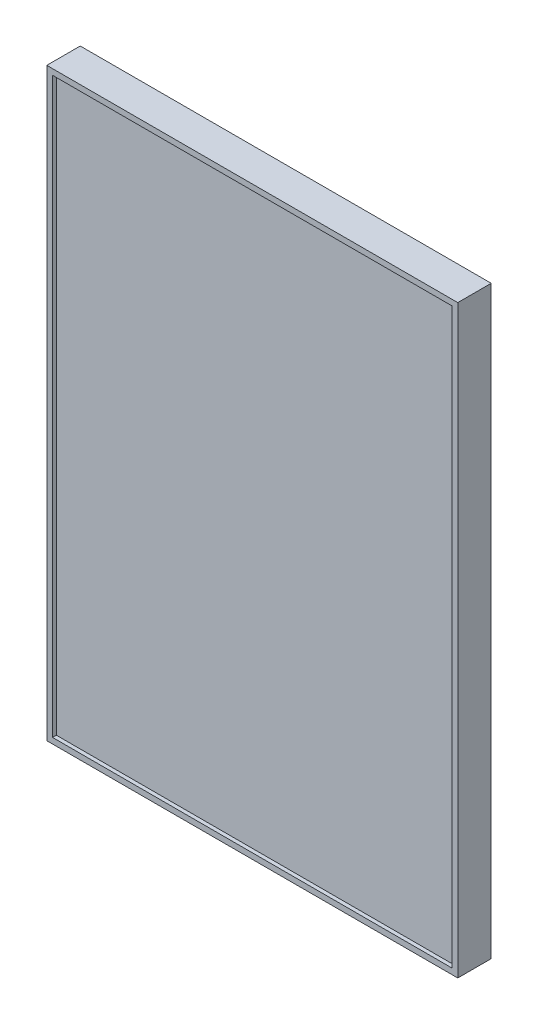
ISO-10303-21;
HEADER;
FILE_DESCRIPTION(('STEP AP214'),'2;1');
FILE_NAME('part.step','',(''),(''),'','','');
FILE_SCHEMA(('AUTOMOTIVE_DESIGN { 1 0 10303 214 1 1 1 1 }'));
ENDSEC;
DATA;
#1=APPLICATION_CONTEXT('core data for automotive mechanical design processes');
#2=APPLICATION_PROTOCOL_DEFINITION('international standard','automotive_design',2000,#1);
#3=PRODUCT_CONTEXT('',#1,'mechanical');
#4=PRODUCT('Part','Part','',(#3));
#5=PRODUCT_RELATED_PRODUCT_CATEGORY('part','',(#4));
#6=PRODUCT_DEFINITION_FORMATION('','',#4);
#7=PRODUCT_DEFINITION_CONTEXT('part definition',#1,'design');
#8=PRODUCT_DEFINITION('design','',#6,#7);
#9=PRODUCT_DEFINITION_SHAPE('','',#8);
#10=(LENGTH_UNIT() NAMED_UNIT(*) SI_UNIT(.MILLI.,.METRE.));
#11=(NAMED_UNIT(*) PLANE_ANGLE_UNIT() SI_UNIT($,.RADIAN.));
#12=(NAMED_UNIT(*) SI_UNIT($,.STERADIAN.) SOLID_ANGLE_UNIT());
#13=UNCERTAINTY_MEASURE_WITH_UNIT(LENGTH_MEASURE(1.E-05),#10,'distance_accuracy_value','');
#14=(GEOMETRIC_REPRESENTATION_CONTEXT(3) GLOBAL_UNCERTAINTY_ASSIGNED_CONTEXT((#13)) GLOBAL_UNIT_ASSIGNED_CONTEXT((#10,
#11,#12)) REPRESENTATION_CONTEXT('',''));
#15=CARTESIAN_POINT('',(0.,0.,0.));
#16=DIRECTION('',(0.,0.,1.));
#17=DIRECTION('',(1.,0.,0.));
#18=AXIS2_PLACEMENT_3D('',#15,#16,#17);
#19=CARTESIAN_POINT('',(0.,306.,17.5));
#20=DIRECTION('',(1.,0.,0.));
#21=DIRECTION('',(0.,1.,0.));
#22=AXIS2_PLACEMENT_3D('',#19,#20,#21);
#23=PLANE('',#22);
#24=DIRECTION('',(0.,-1.,0.));
#25=VECTOR('',#24,1.);
#26=CARTESIAN_POINT('',(0.,306.,0.));
#27=LINE('',#26,#25);
#28=CARTESIAN_POINT('',(0.,306.,0.));
#29=VERTEX_POINT('',#28);
#30=CARTESIAN_POINT('',(0.,0.,0.));
#31=VERTEX_POINT('',#30);
#32=EDGE_CURVE('E230',#29,#31,#27,.T.);
#33=ORIENTED_EDGE('',*,*,#32,.T.);
#34=DIRECTION('',(0.,0.,-1.));
#35=VECTOR('',#34,1.);
#36=CARTESIAN_POINT('',(0.,0.,17.5));
#37=LINE('',#36,#35);
#38=CARTESIAN_POINT('',(0.,0.,17.5));
#39=VERTEX_POINT('',#38);
#40=EDGE_CURVE('E11',#39,#31,#37,.T.);
#41=ORIENTED_EDGE('',*,*,#40,.F.);
#42=DIRECTION('',(0.,-1.,0.));
#43=VECTOR('',#42,1.);
#44=CARTESIAN_POINT('',(0.,306.,17.5));
#45=LINE('',#44,#43);
#46=CARTESIAN_POINT('',(0.,306.,17.5));
#47=VERTEX_POINT('',#46);
#48=EDGE_CURVE('E248',#47,#39,#45,.T.);
#49=ORIENTED_EDGE('',*,*,#48,.F.);
#50=DIRECTION('',(0.,0.,-1.));
#51=VECTOR('',#50,1.);
#52=CARTESIAN_POINT('',(0.,306.,17.5));
#53=LINE('',#52,#51);
#54=EDGE_CURVE('E258',#47,#29,#53,.T.);
#55=ORIENTED_EDGE('',*,*,#54,.T.);
#56=EDGE_LOOP('',(#33,#41,#49,#55));
#57=FACE_BOUND('',#56,.T.);
#58=ADVANCED_FACE('F34',(#57),#23,.F.);
#59=CARTESIAN_POINT('',(0.,0.,17.5));
#60=DIRECTION('',(0.,1.,0.));
#61=DIRECTION('',(0.,0.,1.));
#62=AXIS2_PLACEMENT_3D('',#59,#60,#61);
#63=PLANE('',#62);
#64=DIRECTION('',(1.,0.,0.));
#65=VECTOR('',#64,1.);
#66=CARTESIAN_POINT('',(0.,0.,0.));
#67=LINE('',#66,#65);
#68=CARTESIAN_POINT('',(215.,0.,0.));
#69=VERTEX_POINT('',#68);
#70=EDGE_CURVE('E261',#31,#69,#67,.T.);
#71=ORIENTED_EDGE('',*,*,#70,.T.);
#72=DIRECTION('',(0.,0.,-1.));
#73=VECTOR('',#72,1.);
#74=CARTESIAN_POINT('',(215.,0.,17.5));
#75=LINE('',#74,#73);
#76=CARTESIAN_POINT('',(215.,0.,17.5));
#77=VERTEX_POINT('',#76);
#78=EDGE_CURVE('E41',#77,#69,#75,.T.);
#79=ORIENTED_EDGE('',*,*,#78,.F.);
#80=DIRECTION('',(1.,0.,0.));
#81=VECTOR('',#80,1.);
#82=CARTESIAN_POINT('',(0.,0.,17.5));
#83=LINE('',#82,#81);
#84=EDGE_CURVE('E251',#39,#77,#83,.T.);
#85=ORIENTED_EDGE('',*,*,#84,.F.);
#86=ORIENTED_EDGE('',*,*,#40,.T.);
#87=EDGE_LOOP('',(#71,#79,#85,#86));
#88=FACE_BOUND('',#87,.T.);
#89=ADVANCED_FACE('F290',(#88),#63,.F.);
#90=CARTESIAN_POINT('',(215.,0.,17.5));
#91=DIRECTION('',(-1.,0.,0.));
#92=DIRECTION('',(0.,-1.,0.));
#93=AXIS2_PLACEMENT_3D('',#90,#91,#92);
#94=PLANE('',#93);
#95=DIRECTION('',(0.,1.,0.));
#96=VECTOR('',#95,1.);
#97=CARTESIAN_POINT('',(215.,0.,0.));
#98=LINE('',#97,#96);
#99=CARTESIAN_POINT('',(215.,306.,0.));
#100=VERTEX_POINT('',#99);
#101=EDGE_CURVE('E263',#69,#100,#98,.T.);
#102=ORIENTED_EDGE('',*,*,#101,.T.);
#103=DIRECTION('',(0.,0.,-1.));
#104=VECTOR('',#103,1.);
#105=CARTESIAN_POINT('',(215.,306.,17.5));
#106=LINE('',#105,#104);
#107=CARTESIAN_POINT('',(215.,306.,17.5));
#108=VERTEX_POINT('',#107);
#109=EDGE_CURVE('E268',#108,#100,#106,.T.);
#110=ORIENTED_EDGE('',*,*,#109,.F.);
#111=DIRECTION('',(0.,1.,0.));
#112=VECTOR('',#111,1.);
#113=CARTESIAN_POINT('',(215.,0.,17.5));
#114=LINE('',#113,#112);
#115=EDGE_CURVE('E254',#77,#108,#114,.T.);
#116=ORIENTED_EDGE('',*,*,#115,.F.);
#117=ORIENTED_EDGE('',*,*,#78,.T.);
#118=EDGE_LOOP('',(#102,#110,#116,#117));
#119=FACE_BOUND('',#118,.T.);
#120=ADVANCED_FACE('F275',(#119),#94,.F.);
#121=CARTESIAN_POINT('',(215.,306.,17.5));
#122=DIRECTION('',(0.,-1.,0.));
#123=DIRECTION('',(0.,0.,-1.));
#124=AXIS2_PLACEMENT_3D('',#121,#122,#123);
#125=PLANE('',#124);
#126=DIRECTION('',(-1.,0.,0.));
#127=VECTOR('',#126,1.);
#128=CARTESIAN_POINT('',(215.,306.,0.));
#129=LINE('',#128,#127);
#130=EDGE_CURVE('E252',#100,#29,#129,.T.);
#131=ORIENTED_EDGE('',*,*,#130,.T.);
#132=ORIENTED_EDGE('',*,*,#54,.F.);
#133=DIRECTION('',(-1.,0.,0.));
#134=VECTOR('',#133,1.);
#135=CARTESIAN_POINT('',(215.,306.,17.5));
#136=LINE('',#135,#134);
#137=EDGE_CURVE('E256',#108,#47,#136,.T.);
#138=ORIENTED_EDGE('',*,*,#137,.F.);
#139=ORIENTED_EDGE('',*,*,#109,.T.);
#140=EDGE_LOOP('',(#131,#132,#138,#139));
#141=FACE_BOUND('',#140,.T.);
#142=ADVANCED_FACE('F285',(#141),#125,.F.);
#143=CARTESIAN_POINT('',(0.,0.,17.5));
#144=DIRECTION('',(0.,0.,1.));
#145=DIRECTION('',(1.,0.,0.));
#146=AXIS2_PLACEMENT_3D('',#143,#144,#145);
#147=PLANE('',#146);
#148=DIRECTION('',(0.,-1.,0.));
#149=VECTOR('',#148,1.);
#150=CARTESIAN_POINT('',(3.,306.,17.5));
#151=LINE('',#150,#149);
#152=CARTESIAN_POINT('',(3.,303.,17.5));
#153=VERTEX_POINT('',#152);
#154=CARTESIAN_POINT('',(3.,3.,17.5));
#155=VERTEX_POINT('',#154);
#156=EDGE_CURVE('E148',#153,#155,#151,.T.);
#157=ORIENTED_EDGE('',*,*,#156,.F.);
#158=DIRECTION('',(-1.,0.,0.));
#159=VECTOR('',#158,1.);
#160=CARTESIAN_POINT('',(215.,303.,17.5));
#161=LINE('',#160,#159);
#162=CARTESIAN_POINT('',(212.,303.,17.5));
#163=VERTEX_POINT('',#162);
#164=EDGE_CURVE('E174',#163,#153,#161,.T.);
#165=ORIENTED_EDGE('',*,*,#164,.F.);
#166=DIRECTION('',(0.,1.,0.));
#167=VECTOR('',#166,1.);
#168=CARTESIAN_POINT('',(212.,0.,17.5));
#169=LINE('',#168,#167);
#170=CARTESIAN_POINT('',(212.,3.,17.5));
#171=VERTEX_POINT('',#170);
#172=EDGE_CURVE('E172',#171,#163,#169,.T.);
#173=ORIENTED_EDGE('',*,*,#172,.F.);
#174=DIRECTION('',(1.,0.,0.));
#175=VECTOR('',#174,1.);
#176=CARTESIAN_POINT('',(0.,3.,17.5));
#177=LINE('',#176,#175);
#178=EDGE_CURVE('E158',#155,#171,#177,.T.);
#179=ORIENTED_EDGE('',*,*,#178,.F.);
#180=EDGE_LOOP('',(#157,#165,#173,#179));
#181=FACE_BOUND('',#180,.T.);
#182=ORIENTED_EDGE('',*,*,#48,.T.);
#183=ORIENTED_EDGE('',*,*,#84,.T.);
#184=ORIENTED_EDGE('',*,*,#115,.T.);
#185=ORIENTED_EDGE('',*,*,#137,.T.);
#186=EDGE_LOOP('',(#182,#183,#184,#185));
#187=FACE_BOUND('',#186,.T.);
#188=ADVANCED_FACE('F170',(#181,#187),#147,.T.);
#189=CARTESIAN_POINT('',(0.,0.,0.));
#190=DIRECTION('',(0.,0.,1.));
#191=DIRECTION('',(1.,0.,0.));
#192=AXIS2_PLACEMENT_3D('',#189,#190,#191);
#193=PLANE('',#192);
#194=ORIENTED_EDGE('',*,*,#32,.F.);
#195=ORIENTED_EDGE('',*,*,#130,.F.);
#196=ORIENTED_EDGE('',*,*,#101,.F.);
#197=ORIENTED_EDGE('',*,*,#70,.F.);
#198=EDGE_LOOP('',(#194,#195,#196,#197));
#199=FACE_BOUND('',#198,.T.);
#200=DIRECTION('',(0.,-1.,0.));
#201=VECTOR('',#200,1.);
#202=CARTESIAN_POINT('',(198.5,288.5,0.));
#203=LINE('',#202,#201);
#204=CARTESIAN_POINT('',(198.5,288.5,0.));
#205=VERTEX_POINT('',#204);
#206=CARTESIAN_POINT('',(198.5,16.5,0.));
#207=VERTEX_POINT('',#206);
#208=EDGE_CURVE('E185',#205,#207,#203,.T.);
#209=ORIENTED_EDGE('',*,*,#208,.F.);
#210=DIRECTION('',(1.,0.,0.));
#211=VECTOR('',#210,1.);
#212=CARTESIAN_POINT('',(198.5,288.5,0.));
#213=LINE('',#212,#211);
#214=CARTESIAN_POINT('',(16.5,288.5,0.));
#215=VERTEX_POINT('',#214);
#216=EDGE_CURVE('E190',#215,#205,#213,.T.);
#217=ORIENTED_EDGE('',*,*,#216,.F.);
#218=DIRECTION('',(0.,1.,0.));
#219=VECTOR('',#218,1.);
#220=CARTESIAN_POINT('',(16.5,288.5,0.));
#221=LINE('',#220,#219);
#222=CARTESIAN_POINT('',(16.5,16.5,0.));
#223=VERTEX_POINT('',#222);
#224=EDGE_CURVE('E204',#223,#215,#221,.T.);
#225=ORIENTED_EDGE('',*,*,#224,.F.);
#226=DIRECTION('',(-1.,0.,0.));
#227=VECTOR('',#226,1.);
#228=CARTESIAN_POINT('',(198.5,16.5,0.));
#229=LINE('',#228,#227);
#230=EDGE_CURVE('E201',#207,#223,#229,.T.);
#231=ORIENTED_EDGE('',*,*,#230,.F.);
#232=EDGE_LOOP('',(#209,#217,#225,#231));
#233=FACE_BOUND('',#232,.T.);
#234=ADVANCED_FACE('F281',(#199,#233),#193,.F.);
#235=CARTESIAN_POINT('',(210.,5.,1.5));
#236=DIRECTION('',(0.,0.,-1.));
#237=DIRECTION('',(-1.,0.,0.));
#238=AXIS2_PLACEMENT_3D('',#235,#236,#237);
#239=PLANE('',#238);
#240=DIRECTION('',(1.,0.,0.));
#241=VECTOR('',#240,1.);
#242=CARTESIAN_POINT('',(198.5,288.5,1.5));
#243=LINE('',#242,#241);
#244=CARTESIAN_POINT('',(16.5,288.5,1.5));
#245=VERTEX_POINT('',#244);
#246=CARTESIAN_POINT('',(198.5,288.5,1.5));
#247=VERTEX_POINT('',#246);
#248=EDGE_CURVE('E196',#245,#247,#243,.T.);
#249=ORIENTED_EDGE('',*,*,#248,.T.);
#250=DIRECTION('',(0.,-1.,0.));
#251=VECTOR('',#250,1.);
#252=CARTESIAN_POINT('',(198.5,288.5,1.5));
#253=LINE('',#252,#251);
#254=CARTESIAN_POINT('',(198.5,16.5,1.5));
#255=VERTEX_POINT('',#254);
#256=EDGE_CURVE('E186',#247,#255,#253,.T.);
#257=ORIENTED_EDGE('',*,*,#256,.T.);
#258=DIRECTION('',(-1.,0.,0.));
#259=VECTOR('',#258,1.);
#260=CARTESIAN_POINT('',(198.5,16.5,1.5));
#261=LINE('',#260,#259);
#262=CARTESIAN_POINT('',(16.5,16.5,1.5));
#263=VERTEX_POINT('',#262);
#264=EDGE_CURVE('E189',#255,#263,#261,.T.);
#265=ORIENTED_EDGE('',*,*,#264,.T.);
#266=DIRECTION('',(0.,1.,0.));
#267=VECTOR('',#266,1.);
#268=CARTESIAN_POINT('',(16.5,288.5,1.5));
#269=LINE('',#268,#267);
#270=EDGE_CURVE('E193',#263,#245,#269,.T.);
#271=ORIENTED_EDGE('',*,*,#270,.T.);
#272=EDGE_LOOP('',(#249,#257,#265,#271));
#273=FACE_BOUND('',#272,.T.);
#274=DIRECTION('',(0.,-1.,0.));
#275=VECTOR('',#274,1.);
#276=CARTESIAN_POINT('',(210.,301.,1.5));
#277=LINE('',#276,#275);
#278=CARTESIAN_POINT('',(210.,301.,1.5));
#279=VERTEX_POINT('',#278);
#280=CARTESIAN_POINT('',(210.,5.,1.5));
#281=VERTEX_POINT('',#280);
#282=EDGE_CURVE('E56',#279,#281,#277,.T.);
#283=ORIENTED_EDGE('',*,*,#282,.F.);
#284=DIRECTION('',(1.,0.,0.));
#285=VECTOR('',#284,1.);
#286=CARTESIAN_POINT('',(210.,301.,1.5));
#287=LINE('',#286,#285);
#288=CARTESIAN_POINT('',(5.,301.,1.5));
#289=VERTEX_POINT('',#288);
#290=EDGE_CURVE('E224',#289,#279,#287,.T.);
#291=ORIENTED_EDGE('',*,*,#290,.F.);
#292=DIRECTION('',(0.,1.,0.));
#293=VECTOR('',#292,1.);
#294=CARTESIAN_POINT('',(5.,301.,1.5));
#295=LINE('',#294,#293);
#296=CARTESIAN_POINT('',(5.,5.,1.5));
#297=VERTEX_POINT('',#296);
#298=EDGE_CURVE('E221',#297,#289,#295,.T.);
#299=ORIENTED_EDGE('',*,*,#298,.F.);
#300=DIRECTION('',(-1.,0.,0.));
#301=VECTOR('',#300,1.);
#302=CARTESIAN_POINT('',(210.,5.,1.5));
#303=LINE('',#302,#301);
#304=EDGE_CURVE('E218',#281,#297,#303,.T.);
#305=ORIENTED_EDGE('',*,*,#304,.F.);
#306=EDGE_LOOP('',(#283,#291,#299,#305));
#307=FACE_BOUND('',#306,.T.);
#308=ADVANCED_FACE('F302',(#273,#307),#239,.F.);
#309=CARTESIAN_POINT('',(198.5,288.5,1.5));
#310=DIRECTION('',(1.,0.,0.));
#311=DIRECTION('',(0.,1.,0.));
#312=AXIS2_PLACEMENT_3D('',#309,#310,#311);
#313=PLANE('',#312);
#314=ORIENTED_EDGE('',*,*,#208,.T.);
#315=DIRECTION('',(0.,0.,-1.));
#316=VECTOR('',#315,1.);
#317=CARTESIAN_POINT('',(198.5,16.5,1.5));
#318=LINE('',#317,#316);
#319=EDGE_CURVE('E199',#255,#207,#318,.T.);
#320=ORIENTED_EDGE('',*,*,#319,.F.);
#321=ORIENTED_EDGE('',*,*,#256,.F.);
#322=DIRECTION('',(0.,0.,-1.));
#323=VECTOR('',#322,1.);
#324=CARTESIAN_POINT('',(198.5,288.5,1.5));
#325=LINE('',#324,#323);
#326=EDGE_CURVE('E209',#247,#205,#325,.T.);
#327=ORIENTED_EDGE('',*,*,#326,.T.);
#328=EDGE_LOOP('',(#314,#320,#321,#327));
#329=FACE_BOUND('',#328,.T.);
#330=ADVANCED_FACE('F328',(#329),#313,.F.);
#331=CARTESIAN_POINT('',(198.5,288.5,1.5));
#332=DIRECTION('',(0.,1.,0.));
#333=DIRECTION('',(0.,0.,1.));
#334=AXIS2_PLACEMENT_3D('',#331,#332,#333);
#335=PLANE('',#334);
#336=ORIENTED_EDGE('',*,*,#216,.T.);
#337=ORIENTED_EDGE('',*,*,#326,.F.);
#338=ORIENTED_EDGE('',*,*,#248,.F.);
#339=DIRECTION('',(0.,0.,-1.));
#340=VECTOR('',#339,1.);
#341=CARTESIAN_POINT('',(16.5,288.5,1.5));
#342=LINE('',#341,#340);
#343=EDGE_CURVE('E211',#245,#215,#342,.T.);
#344=ORIENTED_EDGE('',*,*,#343,.T.);
#345=EDGE_LOOP('',(#336,#337,#338,#344));
#346=FACE_BOUND('',#345,.T.);
#347=ADVANCED_FACE('F332',(#346),#335,.F.);
#348=CARTESIAN_POINT('',(16.5,288.5,1.5));
#349=DIRECTION('',(-1.,0.,0.));
#350=DIRECTION('',(0.,-1.,0.));
#351=AXIS2_PLACEMENT_3D('',#348,#349,#350);
#352=PLANE('',#351);
#353=ORIENTED_EDGE('',*,*,#224,.T.);
#354=ORIENTED_EDGE('',*,*,#343,.F.);
#355=ORIENTED_EDGE('',*,*,#270,.F.);
#356=DIRECTION('',(0.,0.,-1.));
#357=VECTOR('',#356,1.);
#358=CARTESIAN_POINT('',(16.5,16.5,1.5));
#359=LINE('',#358,#357);
#360=EDGE_CURVE('E213',#263,#223,#359,.T.);
#361=ORIENTED_EDGE('',*,*,#360,.T.);
#362=EDGE_LOOP('',(#353,#354,#355,#361));
#363=FACE_BOUND('',#362,.T.);
#364=ADVANCED_FACE('F336',(#363),#352,.F.);
#365=CARTESIAN_POINT('',(198.5,16.5,1.5));
#366=DIRECTION('',(0.,-1.,0.));
#367=DIRECTION('',(0.,0.,-1.));
#368=AXIS2_PLACEMENT_3D('',#365,#366,#367);
#369=PLANE('',#368);
#370=ORIENTED_EDGE('',*,*,#230,.T.);
#371=ORIENTED_EDGE('',*,*,#360,.F.);
#372=ORIENTED_EDGE('',*,*,#264,.F.);
#373=ORIENTED_EDGE('',*,*,#319,.T.);
#374=EDGE_LOOP('',(#370,#371,#372,#373));
#375=FACE_BOUND('',#374,.T.);
#376=ADVANCED_FACE('F309',(#375),#369,.F.);
#377=CARTESIAN_POINT('',(0.,0.,12.5));
#378=DIRECTION('',(0.,0.,1.));
#379=DIRECTION('',(1.,0.,0.));
#380=AXIS2_PLACEMENT_3D('',#377,#378,#379);
#381=PLANE('',#380);
#382=DIRECTION('',(0.,-1.,0.));
#383=VECTOR('',#382,1.);
#384=CARTESIAN_POINT('',(5.,306.,12.5));
#385=LINE('',#384,#383);
#386=CARTESIAN_POINT('',(5.,301.,12.5));
#387=VERTEX_POINT('',#386);
#388=CARTESIAN_POINT('',(5.,5.,12.5));
#389=VERTEX_POINT('',#388);
#390=EDGE_CURVE('E226',#387,#389,#385,.T.);
#391=ORIENTED_EDGE('',*,*,#390,.F.);
#392=DIRECTION('',(-1.,0.,0.));
#393=VECTOR('',#392,1.);
#394=CARTESIAN_POINT('',(215.,301.,12.5));
#395=LINE('',#394,#393);
#396=CARTESIAN_POINT('',(210.,301.,12.5));
#397=VERTEX_POINT('',#396);
#398=EDGE_CURVE('E239',#397,#387,#395,.T.);
#399=ORIENTED_EDGE('',*,*,#398,.F.);
#400=DIRECTION('',(0.,1.,0.));
#401=VECTOR('',#400,1.);
#402=CARTESIAN_POINT('',(210.,0.,12.5));
#403=LINE('',#402,#401);
#404=CARTESIAN_POINT('',(210.,5.,12.5));
#405=VERTEX_POINT('',#404);
#406=EDGE_CURVE('E243',#405,#397,#403,.T.);
#407=ORIENTED_EDGE('',*,*,#406,.F.);
#408=DIRECTION('',(1.,0.,0.));
#409=VECTOR('',#408,1.);
#410=CARTESIAN_POINT('',(0.,5.,12.5));
#411=LINE('',#410,#409);
#412=EDGE_CURVE('E234',#389,#405,#411,.T.);
#413=ORIENTED_EDGE('',*,*,#412,.F.);
#414=EDGE_LOOP('',(#391,#399,#407,#413));
#415=FACE_BOUND('',#414,.T.);
#416=ADVANCED_FACE('F305',(#415),#381,.F.);
#417=CARTESIAN_POINT('',(215.,301.,17.5));
#418=DIRECTION('',(0.,-1.,0.));
#419=DIRECTION('',(0.,0.,-1.));
#420=AXIS2_PLACEMENT_3D('',#417,#418,#419);
#421=PLANE('',#420);
#422=DIRECTION('',(0.,0.,-1.));
#423=VECTOR('',#422,1.);
#424=CARTESIAN_POINT('',(5.,301.,17.5));
#425=LINE('',#424,#423);
#426=EDGE_CURVE('E235',#387,#289,#425,.T.);
#427=ORIENTED_EDGE('',*,*,#426,.T.);
#428=ORIENTED_EDGE('',*,*,#290,.T.);
#429=DIRECTION('',(0.,0.,-1.));
#430=VECTOR('',#429,1.);
#431=CARTESIAN_POINT('',(210.,301.,17.5));
#432=LINE('',#431,#430);
#433=EDGE_CURVE('E238',#397,#279,#432,.T.);
#434=ORIENTED_EDGE('',*,*,#433,.F.);
#435=ORIENTED_EDGE('',*,*,#398,.T.);
#436=EDGE_LOOP('',(#427,#428,#434,#435));
#437=FACE_BOUND('',#436,.T.);
#438=ADVANCED_FACE('F308',(#437),#421,.T.);
#439=CARTESIAN_POINT('',(210.,0.,17.5));
#440=DIRECTION('',(-1.,0.,0.));
#441=DIRECTION('',(0.,-1.,0.));
#442=AXIS2_PLACEMENT_3D('',#439,#440,#441);
#443=PLANE('',#442);
#444=ORIENTED_EDGE('',*,*,#433,.T.);
#445=ORIENTED_EDGE('',*,*,#282,.T.);
#446=DIRECTION('',(0.,0.,-1.));
#447=VECTOR('',#446,1.);
#448=CARTESIAN_POINT('',(210.,5.,17.5));
#449=LINE('',#448,#447);
#450=EDGE_CURVE('E231',#405,#281,#449,.T.);
#451=ORIENTED_EDGE('',*,*,#450,.F.);
#452=ORIENTED_EDGE('',*,*,#406,.T.);
#453=EDGE_LOOP('',(#444,#445,#451,#452));
#454=FACE_BOUND('',#453,.T.);
#455=ADVANCED_FACE('F313',(#454),#443,.T.);
#456=CARTESIAN_POINT('',(0.,5.,17.5));
#457=DIRECTION('',(0.,1.,0.));
#458=DIRECTION('',(0.,0.,1.));
#459=AXIS2_PLACEMENT_3D('',#456,#457,#458);
#460=PLANE('',#459);
#461=ORIENTED_EDGE('',*,*,#450,.T.);
#462=ORIENTED_EDGE('',*,*,#304,.T.);
#463=DIRECTION('',(0.,0.,-1.));
#464=VECTOR('',#463,1.);
#465=CARTESIAN_POINT('',(5.,5.,17.5));
#466=LINE('',#465,#464);
#467=EDGE_CURVE('E227',#389,#297,#466,.T.);
#468=ORIENTED_EDGE('',*,*,#467,.F.);
#469=ORIENTED_EDGE('',*,*,#412,.T.);
#470=EDGE_LOOP('',(#461,#462,#468,#469));
#471=FACE_BOUND('',#470,.T.);
#472=ADVANCED_FACE('F317',(#471),#460,.T.);
#473=CARTESIAN_POINT('',(5.,306.,17.5));
#474=DIRECTION('',(1.,0.,0.));
#475=DIRECTION('',(0.,1.,0.));
#476=AXIS2_PLACEMENT_3D('',#473,#474,#475);
#477=PLANE('',#476);
#478=ORIENTED_EDGE('',*,*,#467,.T.);
#479=ORIENTED_EDGE('',*,*,#298,.T.);
#480=ORIENTED_EDGE('',*,*,#426,.F.);
#481=ORIENTED_EDGE('',*,*,#390,.T.);
#482=EDGE_LOOP('',(#478,#479,#480,#481));
#483=FACE_BOUND('',#482,.T.);
#484=ADVANCED_FACE('F321',(#483),#477,.T.);
#485=CARTESIAN_POINT('',(0.,3.,17.5));
#486=DIRECTION('',(0.,1.,0.));
#487=DIRECTION('',(0.,0.,1.));
#488=AXIS2_PLACEMENT_3D('',#485,#486,#487);
#489=PLANE('',#488);
#490=DIRECTION('',(0.,0.,-1.));
#491=VECTOR('',#490,1.);
#492=CARTESIAN_POINT('',(3.,3.,17.5));
#493=LINE('',#492,#491);
#494=CARTESIAN_POINT('',(3.,3.,15.5));
#495=VERTEX_POINT('',#494);
#496=EDGE_CURVE('E152',#155,#495,#493,.T.);
#497=ORIENTED_EDGE('',*,*,#496,.F.);
#498=ORIENTED_EDGE('',*,*,#178,.T.);
#499=DIRECTION('',(0.,0.,-1.));
#500=VECTOR('',#499,1.);
#501=CARTESIAN_POINT('',(212.,3.,17.5));
#502=LINE('',#501,#500);
#503=CARTESIAN_POINT('',(212.,3.,15.5));
#504=VERTEX_POINT('',#503);
#505=EDGE_CURVE('E167',#171,#504,#502,.T.);
#506=ORIENTED_EDGE('',*,*,#505,.T.);
#507=DIRECTION('',(1.,0.,0.));
#508=VECTOR('',#507,1.);
#509=CARTESIAN_POINT('',(0.,3.,15.5));
#510=LINE('',#509,#508);
#511=EDGE_CURVE('E164',#495,#504,#510,.T.);
#512=ORIENTED_EDGE('',*,*,#511,.F.);
#513=EDGE_LOOP('',(#497,#498,#506,#512));
#514=FACE_BOUND('',#513,.T.);
#515=ADVANCED_FACE('F161',(#514),#489,.T.);
#516=CARTESIAN_POINT('',(212.,0.,17.5));
#517=DIRECTION('',(-1.,0.,0.));
#518=DIRECTION('',(0.,-1.,0.));
#519=AXIS2_PLACEMENT_3D('',#516,#517,#518);
#520=PLANE('',#519);
#521=ORIENTED_EDGE('',*,*,#505,.F.);
#522=ORIENTED_EDGE('',*,*,#172,.T.);
#523=DIRECTION('',(0.,0.,-1.));
#524=VECTOR('',#523,1.);
#525=CARTESIAN_POINT('',(212.,303.,17.5));
#526=LINE('',#525,#524);
#527=CARTESIAN_POINT('',(212.,303.,15.5));
#528=VERTEX_POINT('',#527);
#529=EDGE_CURVE('E48',#163,#528,#526,.T.);
#530=ORIENTED_EDGE('',*,*,#529,.T.);
#531=DIRECTION('',(0.,1.,0.));
#532=VECTOR('',#531,1.);
#533=CARTESIAN_POINT('',(212.,0.,15.5));
#534=LINE('',#533,#532);
#535=EDGE_CURVE('E182',#504,#528,#534,.T.);
#536=ORIENTED_EDGE('',*,*,#535,.F.);
#537=EDGE_LOOP('',(#521,#522,#530,#536));
#538=FACE_BOUND('',#537,.T.);
#539=ADVANCED_FACE('F351',(#538),#520,.T.);
#540=CARTESIAN_POINT('',(215.,303.,17.5));
#541=DIRECTION('',(0.,-1.,0.));
#542=DIRECTION('',(0.,0.,-1.));
#543=AXIS2_PLACEMENT_3D('',#540,#541,#542);
#544=PLANE('',#543);
#545=ORIENTED_EDGE('',*,*,#529,.F.);
#546=ORIENTED_EDGE('',*,*,#164,.T.);
#547=DIRECTION('',(0.,0.,-1.));
#548=VECTOR('',#547,1.);
#549=CARTESIAN_POINT('',(3.,303.,17.5));
#550=LINE('',#549,#548);
#551=CARTESIAN_POINT('',(3.,303.,15.5));
#552=VERTEX_POINT('',#551);
#553=EDGE_CURVE('E154',#153,#552,#550,.T.);
#554=ORIENTED_EDGE('',*,*,#553,.T.);
#555=DIRECTION('',(-1.,0.,0.));
#556=VECTOR('',#555,1.);
#557=CARTESIAN_POINT('',(215.,303.,15.5));
#558=LINE('',#557,#556);
#559=EDGE_CURVE('E180',#528,#552,#558,.T.);
#560=ORIENTED_EDGE('',*,*,#559,.F.);
#561=EDGE_LOOP('',(#545,#546,#554,#560));
#562=FACE_BOUND('',#561,.T.);
#563=ADVANCED_FACE('F348',(#562),#544,.T.);
#564=CARTESIAN_POINT('',(3.,306.,17.5));
#565=DIRECTION('',(1.,0.,0.));
#566=DIRECTION('',(0.,1.,0.));
#567=AXIS2_PLACEMENT_3D('',#564,#565,#566);
#568=PLANE('',#567);
#569=ORIENTED_EDGE('',*,*,#553,.F.);
#570=ORIENTED_EDGE('',*,*,#156,.T.);
#571=ORIENTED_EDGE('',*,*,#496,.T.);
#572=DIRECTION('',(0.,-1.,0.));
#573=VECTOR('',#572,1.);
#574=CARTESIAN_POINT('',(3.,306.,15.5));
#575=LINE('',#574,#573);
#576=EDGE_CURVE('E166',#552,#495,#575,.T.);
#577=ORIENTED_EDGE('',*,*,#576,.F.);
#578=EDGE_LOOP('',(#569,#570,#571,#577));
#579=FACE_BOUND('',#578,.T.);
#580=ADVANCED_FACE('F150',(#579),#568,.T.);
#581=CARTESIAN_POINT('',(0.,0.,15.5));
#582=DIRECTION('',(0.,0.,1.));
#583=DIRECTION('',(1.,0.,0.));
#584=AXIS2_PLACEMENT_3D('',#581,#582,#583);
#585=PLANE('',#584);
#586=ORIENTED_EDGE('',*,*,#511,.T.);
#587=ORIENTED_EDGE('',*,*,#535,.T.);
#588=ORIENTED_EDGE('',*,*,#559,.T.);
#589=ORIENTED_EDGE('',*,*,#576,.T.);
#590=EDGE_LOOP('',(#586,#587,#588,#589));
#591=FACE_BOUND('',#590,.T.);
#592=ADVANCED_FACE('F344',(#591),#585,.T.);
#593=CLOSED_SHELL('',(#58,#89,#120,#142,#188,#234,#308,#330,#347,#364,#376,#416,#438,#455,#472,
#484,#515,#539,#563,#580,#592));
#594=MANIFOLD_SOLID_BREP('B2',#593);
#595=ADVANCED_BREP_SHAPE_REPRESENTATION('',(#18,#594),#14);
#596=SHAPE_DEFINITION_REPRESENTATION(#9,#595);
ENDSEC;
END-ISO-10303-21;
